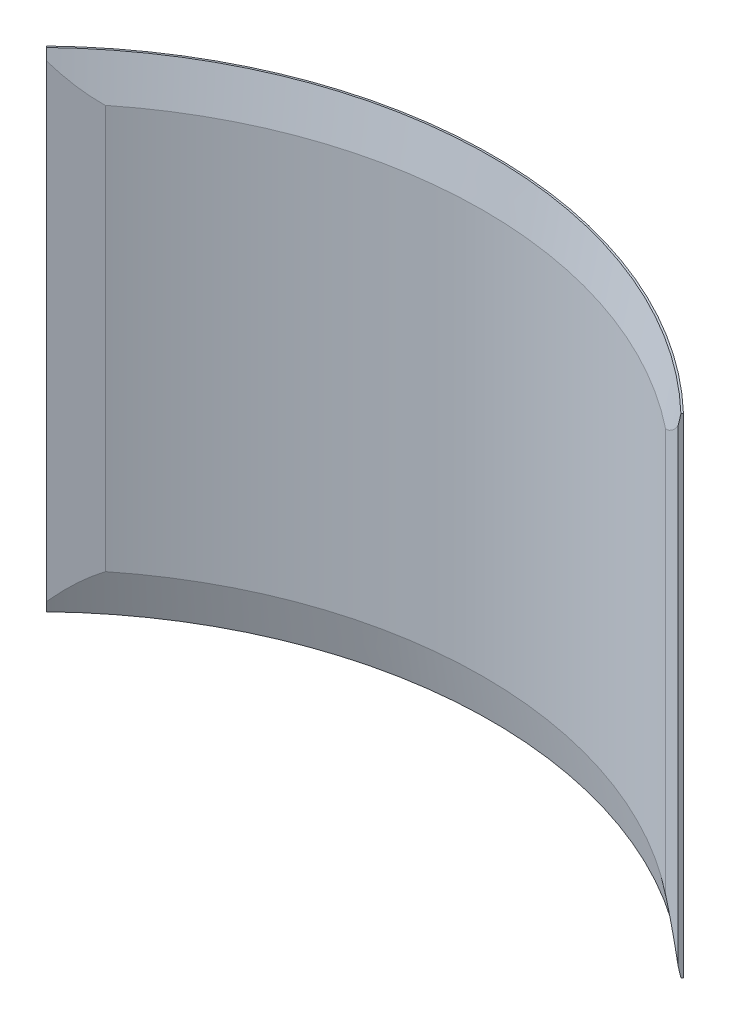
ISO-10303-21;
HEADER;
FILE_DESCRIPTION(('STEP AP214'),'2;1');
FILE_NAME('part.step','',(''),(''),'','','');
FILE_SCHEMA(('AUTOMOTIVE_DESIGN { 1 0 10303 214 1 1 1 1 }'));
ENDSEC;
DATA;
#1=APPLICATION_CONTEXT('core data for automotive mechanical design processes');
#2=APPLICATION_PROTOCOL_DEFINITION('international standard','automotive_design',2000,#1);
#3=PRODUCT_CONTEXT('',#1,'mechanical');
#4=PRODUCT('Part','Part','',(#3));
#5=PRODUCT_RELATED_PRODUCT_CATEGORY('part','',(#4));
#6=PRODUCT_DEFINITION_FORMATION('','',#4);
#7=PRODUCT_DEFINITION_CONTEXT('part definition',#1,'design');
#8=PRODUCT_DEFINITION('design','',#6,#7);
#9=PRODUCT_DEFINITION_SHAPE('','',#8);
#10=(LENGTH_UNIT() NAMED_UNIT(*) SI_UNIT(.MILLI.,.METRE.));
#11=(NAMED_UNIT(*) PLANE_ANGLE_UNIT() SI_UNIT($,.RADIAN.));
#12=(NAMED_UNIT(*) SI_UNIT($,.STERADIAN.) SOLID_ANGLE_UNIT());
#13=UNCERTAINTY_MEASURE_WITH_UNIT(LENGTH_MEASURE(1.E-05),#10,'distance_accuracy_value','');
#14=(GEOMETRIC_REPRESENTATION_CONTEXT(3) GLOBAL_UNCERTAINTY_ASSIGNED_CONTEXT((#13)) GLOBAL_UNIT_ASSIGNED_CONTEXT((#10,
#11,#12)) REPRESENTATION_CONTEXT('',''));
#15=CARTESIAN_POINT('',(0.,0.,0.));
#16=DIRECTION('',(0.,0.,1.));
#17=DIRECTION('',(1.,0.,0.));
#18=AXIS2_PLACEMENT_3D('',#15,#16,#17);
#19=CARTESIAN_POINT('',(81.915,125.73,85.0961057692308));
#20=DIRECTION('',(0.,-1.,0.));
#21=DIRECTION('',(0.,0.,-1.));
#22=AXIS2_PLACEMENT_3D('',#19,#20,#21);
#23=CYLINDRICAL_SURFACE('',#22,115.576105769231);
#24=DIRECTION('',(0.,-1.,0.));
#25=VECTOR('',#24,1.);
#26=CARTESIAN_POINT('',(9.83701288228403,125.73,-5.25100263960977));
#27=LINE('',#26,#25);
#28=CARTESIAN_POINT('',(9.83701288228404,114.808,-5.25100263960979));
#29=VERTEX_POINT('',#28);
#30=CARTESIAN_POINT('',(9.83701288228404,10.922,-5.25100263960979));
#31=VERTEX_POINT('',#30);
#32=EDGE_CURVE('E105',#29,#31,#27,.T.);
#33=ORIENTED_EDGE('',*,*,#32,.T.);
#34=CARTESIAN_POINT('',(81.915,10.922,85.0961057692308));
#35=DIRECTION('',(0.,1.,0.));
#36=DIRECTION('',(0.,0.,1.));
#37=AXIS2_PLACEMENT_3D('',#34,#35,#36);
#38=CIRCLE('',#37,115.576105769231);
#39=CARTESIAN_POINT('',(153.992987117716,10.922,-5.25100263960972));
#40=VERTEX_POINT('',#39);
#41=EDGE_CURVE('E136',#31,#40,#38,.F.);
#42=ORIENTED_EDGE('',*,*,#41,.T.);
#43=DIRECTION('',(0.,-1.,0.));
#44=VECTOR('',#43,1.);
#45=CARTESIAN_POINT('',(153.992987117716,125.73,-5.2510026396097));
#46=LINE('',#45,#44);
#47=CARTESIAN_POINT('',(153.992987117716,114.808,-5.25100263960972));
#48=VERTEX_POINT('',#47);
#49=EDGE_CURVE('E134',#40,#48,#46,.F.);
#50=ORIENTED_EDGE('',*,*,#49,.T.);
#51=CARTESIAN_POINT('',(81.915,114.808,85.0961057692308));
#52=DIRECTION('',(0.,1.,0.));
#53=DIRECTION('',(0.,0.,1.));
#54=AXIS2_PLACEMENT_3D('',#51,#52,#53);
#55=CIRCLE('',#54,115.576105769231);
#56=EDGE_CURVE('E132',#48,#29,#55,.T.);
#57=ORIENTED_EDGE('',*,*,#56,.T.);
#58=EDGE_LOOP('',(#33,#42,#50,#57));
#59=FACE_BOUND('',#58,.T.);
#60=ADVANCED_FACE('F34',(#59),#23,.F.);
#61=CARTESIAN_POINT('',(163.83,125.73,0.));
#62=DIRECTION('',(0.720444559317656,0.,0.693512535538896));
#63=DIRECTION('',(0.693512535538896,0.,-0.720444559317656));
#64=AXIS2_PLACEMENT_3D('',#61,#62,#63);
#65=PLANE('',#64);
#66=DIRECTION('',(0.,-1.,0.));
#67=VECTOR('',#66,1.);
#68=CARTESIAN_POINT('',(163.160601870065,0.,0.695393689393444));
#69=LINE('',#68,#67);
#70=CARTESIAN_POINT('',(163.160601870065,123.065947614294,0.695393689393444));
#71=VERTEX_POINT('',#70);
#72=CARTESIAN_POINT('',(163.160601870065,2.66405238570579,0.695393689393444));
#73=VERTEX_POINT('',#72);
#74=EDGE_CURVE('E141',#71,#73,#69,.T.);
#75=ORIENTED_EDGE('',*,*,#74,.T.);
#76=DIRECTION('',(-0.129910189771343,0.982298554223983,0.134955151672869));
#77=VECTOR('',#76,1.);
#78=CARTESIAN_POINT('',(81.9150000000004,616.991822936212,85.0961057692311));
#79=LINE('',#78,#77);
#80=CARTESIAN_POINT('',(163.512926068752,0.,0.329387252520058));
#81=VERTEX_POINT('',#80);
#82=EDGE_CURVE('E112',#73,#81,#79,.F.);
#83=ORIENTED_EDGE('',*,*,#82,.T.);
#84=DIRECTION('',(-0.693512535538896,0.,0.720444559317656));
#85=VECTOR('',#84,1.);
#86=CARTESIAN_POINT('',(163.83,0.,0.));
#87=LINE('',#86,#85);
#88=CARTESIAN_POINT('',(163.83,0.,0.));
#89=VERTEX_POINT('',#88);
#90=EDGE_CURVE('E109',#89,#81,#87,.T.);
#91=ORIENTED_EDGE('',*,*,#90,.F.);
#92=DIRECTION('',(0.,-1.,0.));
#93=VECTOR('',#92,1.);
#94=CARTESIAN_POINT('',(163.83,125.73,0.));
#95=LINE('',#94,#93);
#96=CARTESIAN_POINT('',(163.83,125.73,0.));
#97=VERTEX_POINT('',#96);
#98=EDGE_CURVE('E94',#97,#89,#95,.T.);
#99=ORIENTED_EDGE('',*,*,#98,.F.);
#100=DIRECTION('',(-0.693512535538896,0.,0.720444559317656));
#101=VECTOR('',#100,1.);
#102=CARTESIAN_POINT('',(163.83,125.73,0.));
#103=LINE('',#102,#101);
#104=CARTESIAN_POINT('',(163.512926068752,125.73,0.329387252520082));
#105=VERTEX_POINT('',#104);
#106=EDGE_CURVE('E122',#97,#105,#103,.T.);
#107=ORIENTED_EDGE('',*,*,#106,.T.);
#108=DIRECTION('',(0.129910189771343,0.982298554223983,-0.134955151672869));
#109=VECTOR('',#108,1.);
#110=CARTESIAN_POINT('',(81.9150000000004,-491.261822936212,85.0961057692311));
#111=LINE('',#110,#109);
#112=EDGE_CURVE('E139',#105,#71,#111,.F.);
#113=ORIENTED_EDGE('',*,*,#112,.T.);
#114=EDGE_LOOP('',(#75,#83,#91,#99,#107,#113));
#115=FACE_BOUND('',#114,.T.);
#116=ADVANCED_FACE('F110',(#115),#65,.T.);
#117=CARTESIAN_POINT('',(81.915,125.73,85.0961057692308));
#118=DIRECTION('',(0.,-1.,0.));
#119=DIRECTION('',(0.,0.,-1.));
#120=AXIS2_PLACEMENT_3D('',#117,#118,#119);
#121=CYLINDRICAL_SURFACE('',#120,118.116105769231);
#122=CARTESIAN_POINT('',(81.915,0.,85.0961057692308));
#123=DIRECTION('',(0.,-1.,0.));
#124=DIRECTION('',(0.,0.,-1.));
#125=AXIS2_PLACEMENT_3D('',#122,#123,#124);
#126=CIRCLE('',#125,118.116105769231);
#127=CARTESIAN_POINT('',(0.,0.,0.));
#128=VERTEX_POINT('',#127);
#129=EDGE_CURVE('E99',#128,#89,#126,.T.);
#130=ORIENTED_EDGE('',*,*,#129,.F.);
#131=DIRECTION('',(0.,-1.,0.));
#132=VECTOR('',#131,1.);
#133=CARTESIAN_POINT('',(0.,125.73,0.));
#134=LINE('',#133,#132);
#135=CARTESIAN_POINT('',(0.,125.73,0.));
#136=VERTEX_POINT('',#135);
#137=EDGE_CURVE('E106',#136,#128,#134,.T.);
#138=ORIENTED_EDGE('',*,*,#137,.F.);
#139=CARTESIAN_POINT('',(81.915,125.73,85.0961057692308));
#140=DIRECTION('',(0.,-1.,0.));
#141=DIRECTION('',(0.,0.,-1.));
#142=AXIS2_PLACEMENT_3D('',#139,#140,#141);
#143=CIRCLE('',#142,118.116105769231);
#144=EDGE_CURVE('E101',#136,#97,#143,.T.);
#145=ORIENTED_EDGE('',*,*,#144,.T.);
#146=ORIENTED_EDGE('',*,*,#98,.T.);
#147=EDGE_LOOP('',(#130,#138,#145,#146));
#148=FACE_BOUND('',#147,.T.);
#149=ADVANCED_FACE('F96',(#148),#121,.T.);
#150=CARTESIAN_POINT('',(1.76152184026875,125.73,1.82992918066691));
#151=DIRECTION('',(-0.720444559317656,0.,0.693512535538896));
#152=DIRECTION('',(0.693512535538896,0.,0.720444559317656));
#153=AXIS2_PLACEMENT_3D('',#150,#151,#152);
#154=PLANE('',#153);
#155=DIRECTION('',(-0.693512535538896,0.,-0.720444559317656));
#156=VECTOR('',#155,1.);
#157=CARTESIAN_POINT('',(1.76152184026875,0.,1.82992918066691));
#158=LINE('',#157,#156);
#159=CARTESIAN_POINT('',(0.317073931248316,-1.66533453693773E-13,0.329387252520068));
#160=VERTEX_POINT('',#159);
#161=EDGE_CURVE('E119',#160,#128,#158,.T.);
#162=ORIENTED_EDGE('',*,*,#161,.F.);
#163=DIRECTION('',(-0.129910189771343,-0.982298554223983,-0.134955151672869));
#164=VECTOR('',#163,1.);
#165=CARTESIAN_POINT('',(81.9149999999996,616.991822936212,85.0961057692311));
#166=LINE('',#165,#164);
#167=CARTESIAN_POINT('',(0.669398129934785,2.66405238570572,0.695393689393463));
#168=VERTEX_POINT('',#167);
#169=EDGE_CURVE('E41',#160,#168,#166,.F.);
#170=ORIENTED_EDGE('',*,*,#169,.T.);
#171=DIRECTION('',(0.,1.,0.));
#172=VECTOR('',#171,1.);
#173=CARTESIAN_POINT('',(0.669398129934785,125.73,0.695393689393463));
#174=LINE('',#173,#172);
#175=CARTESIAN_POINT('',(0.669398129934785,123.065947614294,0.695393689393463));
#176=VERTEX_POINT('',#175);
#177=EDGE_CURVE('E48',#168,#176,#174,.T.);
#178=ORIENTED_EDGE('',*,*,#177,.T.);
#179=DIRECTION('',(0.129910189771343,-0.982298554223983,0.134955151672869));
#180=VECTOR('',#179,1.);
#181=CARTESIAN_POINT('',(81.9149999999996,-491.261822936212,85.0961057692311));
#182=LINE('',#181,#180);
#183=CARTESIAN_POINT('',(0.317073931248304,125.73,0.329387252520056));
#184=VERTEX_POINT('',#183);
#185=EDGE_CURVE('E147',#176,#184,#182,.F.);
#186=ORIENTED_EDGE('',*,*,#185,.T.);
#187=DIRECTION('',(-0.693512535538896,0.,-0.720444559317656));
#188=VECTOR('',#187,1.);
#189=CARTESIAN_POINT('',(1.76152184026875,125.73,1.82992918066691));
#190=LINE('',#189,#188);
#191=EDGE_CURVE('E128',#184,#136,#190,.T.);
#192=ORIENTED_EDGE('',*,*,#191,.T.);
#193=ORIENTED_EDGE('',*,*,#137,.T.);
#194=EDGE_LOOP('',(#162,#170,#178,#186,#192,#193));
#195=FACE_BOUND('',#194,.T.);
#196=ADVANCED_FACE('F149',(#195),#154,.T.);
#197=CARTESIAN_POINT('',(81.915,125.73,85.0961057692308));
#198=DIRECTION('',(0.,1.,0.));
#199=DIRECTION('',(0.,0.,1.));
#200=AXIS2_PLACEMENT_3D('',#197,#198,#199);
#201=PLANE('',#200);
#202=ORIENTED_EDGE('',*,*,#191,.F.);
#203=CARTESIAN_POINT('',(81.915,125.73,85.0961057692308));
#204=DIRECTION('',(0.,1.,0.));
#205=DIRECTION('',(0.,0.,1.));
#206=AXIS2_PLACEMENT_3D('',#203,#204,#205);
#207=CIRCLE('',#206,117.658905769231);
#208=EDGE_CURVE('E11',#184,#105,#207,.F.);
#209=ORIENTED_EDGE('',*,*,#208,.T.);
#210=ORIENTED_EDGE('',*,*,#106,.F.);
#211=ORIENTED_EDGE('',*,*,#144,.F.);
#212=EDGE_LOOP('',(#202,#209,#210,#211));
#213=FACE_BOUND('',#212,.T.);
#214=ADVANCED_FACE('F155',(#213),#201,.T.);
#215=CARTESIAN_POINT('',(81.915,0.,85.0961057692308));
#216=DIRECTION('',(0.,1.,0.));
#217=DIRECTION('',(0.,0.,1.));
#218=AXIS2_PLACEMENT_3D('',#215,#216,#217);
#219=PLANE('',#218);
#220=ORIENTED_EDGE('',*,*,#90,.T.);
#221=CARTESIAN_POINT('',(81.915,0.,85.0961057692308));
#222=DIRECTION('',(0.,1.,0.));
#223=DIRECTION('',(0.,0.,1.));
#224=AXIS2_PLACEMENT_3D('',#221,#222,#223);
#225=CIRCLE('',#224,117.658905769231);
#226=EDGE_CURVE('E144',#81,#160,#225,.T.);
#227=ORIENTED_EDGE('',*,*,#226,.T.);
#228=ORIENTED_EDGE('',*,*,#161,.T.);
#229=ORIENTED_EDGE('',*,*,#129,.T.);
#230=EDGE_LOOP('',(#220,#227,#228,#229));
#231=FACE_BOUND('',#230,.T.);
#232=ADVANCED_FACE('F118',(#231),#219,.F.);
#233=CARTESIAN_POINT('',(81.915,125.73,85.0961057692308));
#234=DIRECTION('',(0.,1.,0.));
#235=DIRECTION('',(0.,0.,1.));
#236=AXIS2_PLACEMENT_3D('',#233,#234,#235);
#237=CONICAL_SURFACE('',#236,117.658905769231,0.188435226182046);
#238=ORIENTED_EDGE('',*,*,#208,.F.);
#239=ORIENTED_EDGE('',*,*,#185,.F.);
#240=CARTESIAN_POINT('',(9.83701288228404,114.808,-5.25100263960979));
#241=CARTESIAN_POINT('',(9.4076831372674,115.070526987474,-4.97252618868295));
#242=CARTESIAN_POINT('',(8.98449875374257,115.346905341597,-4.69803580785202));
#243=CARTESIAN_POINT('',(8.15042151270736,115.924357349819,-4.15702770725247));
#244=CARTESIAN_POINT('',(7.73952262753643,116.225418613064,-3.89050607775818));
#245=CARTESIAN_POINT('',(6.52939146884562,117.157861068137,-3.1055778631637));
#246=CARTESIAN_POINT('',(5.74767704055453,117.821660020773,-2.59853389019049));
#247=CARTESIAN_POINT('',(4.22895517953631,119.216404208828,-1.61344427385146));
#248=CARTESIAN_POINT('',(3.49192078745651,119.947308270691,-1.13538114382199));
#249=CARTESIAN_POINT('',(2.41421104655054,121.085810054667,-0.43634552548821));
#250=CARTESIAN_POINT('',(2.05858963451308,121.47356283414,-0.205678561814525));
#251=CARTESIAN_POINT('',(1.35695484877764,122.261074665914,0.249423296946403));
#252=CARTESIAN_POINT('',(1.01093958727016,122.660831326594,0.473859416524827));
#253=CARTESIAN_POINT('',(0.669398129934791,123.065947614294,0.69539368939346));
#254=B_SPLINE_CURVE_WITH_KNOTS('',3,(#240,#241,#242,#243,#244,#245,#246,#247,#248,#249,#250,
#251,#252,#253),.UNSPECIFIED.,.F.,.F.,(4,2,2,2,2,2,4),(0.,1.72491646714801,3.44897226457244,
6.87678074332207,10.3024999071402,12.0257359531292,13.7486309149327),.UNSPECIFIED.);
#255=EDGE_CURVE('E116',#29,#176,#254,.T.);
#256=ORIENTED_EDGE('',*,*,#255,.F.);
#257=ORIENTED_EDGE('',*,*,#56,.F.);
#258=CARTESIAN_POINT('',(153.992987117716,114.808,-5.25100263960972));
#259=CARTESIAN_POINT('',(154.422316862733,115.070526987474,-4.97252618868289));
#260=CARTESIAN_POINT('',(154.845501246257,115.346905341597,-4.69803580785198));
#261=CARTESIAN_POINT('',(155.679578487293,115.924357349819,-4.15702770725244));
#262=CARTESIAN_POINT('',(156.090477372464,116.225418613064,-3.89050607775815));
#263=CARTESIAN_POINT('',(157.300608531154,117.157861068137,-3.10557786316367));
#264=CARTESIAN_POINT('',(158.082322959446,117.821660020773,-2.59853389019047));
#265=CARTESIAN_POINT('',(159.601044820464,119.216404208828,-1.61344427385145));
#266=CARTESIAN_POINT('',(160.338079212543,119.947308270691,-1.13538114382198));
#267=CARTESIAN_POINT('',(161.415788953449,121.085810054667,-0.436345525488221));
#268=CARTESIAN_POINT('',(161.771410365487,121.47356283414,-0.205678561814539));
#269=CARTESIAN_POINT('',(162.473045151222,122.261074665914,0.24942329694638));
#270=CARTESIAN_POINT('',(162.81906041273,122.660831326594,0.473859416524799));
#271=CARTESIAN_POINT('',(163.160601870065,123.065947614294,0.695393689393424));
#272=B_SPLINE_CURVE_WITH_KNOTS('',3,(#258,#259,#260,#261,#262,#263,#264,#265,#266,#267,#268,
#269,#270,#271),.UNSPECIFIED.,.F.,.F.,(4,2,2,2,2,2,4),(0.,1.72491646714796,3.44897226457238,
6.876780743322,10.3024999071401,12.0257359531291,13.7486309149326),.UNSPECIFIED.);
#273=EDGE_CURVE('E161',#71,#48,#272,.F.);
#274=ORIENTED_EDGE('',*,*,#273,.F.);
#275=ORIENTED_EDGE('',*,*,#112,.F.);
#276=EDGE_LOOP('',(#238,#239,#256,#257,#274,#275));
#277=FACE_BOUND('',#276,.T.);
#278=ADVANCED_FACE('F157',(#277),#237,.F.);
#279=CARTESIAN_POINT('',(9.83701288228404,125.73,-5.2510026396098));
#280=DIRECTION('',(-0.544180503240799,0.,-0.838968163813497));
#281=DIRECTION('',(-0.838968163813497,0.,0.544180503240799));
#282=AXIS2_PLACEMENT_3D('',#279,#280,#281);
#283=PLANE('',#282);
#284=ORIENTED_EDGE('',*,*,#255,.T.);
#285=ORIENTED_EDGE('',*,*,#177,.F.);
#286=CARTESIAN_POINT('',(0.669398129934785,2.66405238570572,0.695393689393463));
#287=CARTESIAN_POINT('',(1.01093958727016,3.06916867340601,0.473859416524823));
#288=CARTESIAN_POINT('',(1.35695484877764,3.46892533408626,0.249423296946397));
#289=CARTESIAN_POINT('',(2.05858963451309,4.25643716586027,-0.205678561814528));
#290=CARTESIAN_POINT('',(2.41421104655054,4.64418994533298,-0.43634552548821));
#291=CARTESIAN_POINT('',(3.4919207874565,5.78269172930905,-1.13538114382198));
#292=CARTESIAN_POINT('',(4.22895517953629,6.51359579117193,-1.61344427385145));
#293=CARTESIAN_POINT('',(5.7476770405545,7.90833997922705,-2.59853389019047));
#294=CARTESIAN_POINT('',(6.52939146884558,8.57213893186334,-3.10557786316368));
#295=CARTESIAN_POINT('',(7.73952262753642,9.50458138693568,-3.89050607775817));
#296=CARTESIAN_POINT('',(8.15042151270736,9.80564265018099,-4.15702770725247));
#297=CARTESIAN_POINT('',(8.98449875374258,10.3830946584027,-4.69803580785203));
#298=CARTESIAN_POINT('',(9.40768313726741,10.6594730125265,-4.97252618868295));
#299=CARTESIAN_POINT('',(9.83701288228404,10.922,-5.2510026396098));
#300=B_SPLINE_CURVE_WITH_KNOTS('',3,(#286,#287,#288,#289,#290,#291,#292,#293,#294,#295,#296,
#297,#298,#299),.UNSPECIFIED.,.F.,.F.,(4,2,2,2,2,2,4),(0.,1.72289496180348,3.44613100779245,
6.87185017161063,10.2996586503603,12.0237144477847,13.7486309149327),.UNSPECIFIED.);
#301=EDGE_CURVE('E170',#31,#168,#300,.F.);
#302=ORIENTED_EDGE('',*,*,#301,.F.);
#303=ORIENTED_EDGE('',*,*,#32,.F.);
#304=EDGE_LOOP('',(#284,#285,#302,#303));
#305=FACE_BOUND('',#304,.T.);
#306=ADVANCED_FACE('F192',(#305),#283,.F.);
#307=CARTESIAN_POINT('',(163.160601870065,125.73,0.695393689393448));
#308=DIRECTION('',(0.544180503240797,0.,-0.838968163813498));
#309=DIRECTION('',(-0.838968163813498,0.,-0.544180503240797));
#310=AXIS2_PLACEMENT_3D('',#307,#308,#309);
#311=PLANE('',#310);
#312=ORIENTED_EDGE('',*,*,#273,.T.);
#313=ORIENTED_EDGE('',*,*,#49,.F.);
#314=CARTESIAN_POINT('',(153.992987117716,10.922,-5.25100263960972));
#315=CARTESIAN_POINT('',(154.422316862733,10.6594730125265,-4.97252618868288));
#316=CARTESIAN_POINT('',(154.845501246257,10.3830946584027,-4.69803580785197));
#317=CARTESIAN_POINT('',(155.679578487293,9.80564265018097,-4.15702770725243));
#318=CARTESIAN_POINT('',(156.090477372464,9.50458138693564,-3.89050607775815));
#319=CARTESIAN_POINT('',(157.300608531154,8.57213893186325,-3.10557786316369));
#320=CARTESIAN_POINT('',(158.082322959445,7.908339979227,-2.59853389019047));
#321=CARTESIAN_POINT('',(159.601044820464,6.51359579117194,-1.61344427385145));
#322=CARTESIAN_POINT('',(160.338079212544,5.78269172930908,-1.13538114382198));
#323=CARTESIAN_POINT('',(161.415788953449,4.644189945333,-0.436345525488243));
#324=CARTESIAN_POINT('',(161.771410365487,4.25643716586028,-0.205678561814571));
#325=CARTESIAN_POINT('',(162.473045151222,3.46892533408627,0.249423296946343));
#326=CARTESIAN_POINT('',(162.81906041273,3.06916867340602,0.473859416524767));
#327=CARTESIAN_POINT('',(163.160601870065,2.66405238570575,0.695393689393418));
#328=B_SPLINE_CURVE_WITH_KNOTS('',3,(#314,#315,#316,#317,#318,#319,#320,#321,#322,#323,#324,
#325,#326,#327),.UNSPECIFIED.,.F.,.F.,(4,2,2,2,2,2,4),(0.,1.72491646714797,3.44897226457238,
6.876780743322,10.3024999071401,12.025735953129,13.7486309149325),.UNSPECIFIED.);
#329=EDGE_CURVE('E166',#73,#40,#328,.F.);
#330=ORIENTED_EDGE('',*,*,#329,.F.);
#331=ORIENTED_EDGE('',*,*,#74,.F.);
#332=EDGE_LOOP('',(#312,#313,#330,#331));
#333=FACE_BOUND('',#332,.T.);
#334=ADVANCED_FACE('F167',(#333),#311,.F.);
#335=CARTESIAN_POINT('',(81.915,10.922,85.0961057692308));
#336=DIRECTION('',(0.,-1.,0.));
#337=DIRECTION('',(0.,0.,-1.));
#338=AXIS2_PLACEMENT_3D('',#335,#336,#337);
#339=CONICAL_SURFACE('',#338,115.576105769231,0.188435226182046);
#340=ORIENTED_EDGE('',*,*,#169,.F.);
#341=ORIENTED_EDGE('',*,*,#226,.F.);
#342=ORIENTED_EDGE('',*,*,#82,.F.);
#343=ORIENTED_EDGE('',*,*,#329,.T.);
#344=ORIENTED_EDGE('',*,*,#41,.F.);
#345=ORIENTED_EDGE('',*,*,#301,.T.);
#346=EDGE_LOOP('',(#340,#341,#342,#343,#344,#345));
#347=FACE_BOUND('',#346,.T.);
#348=ADVANCED_FACE('F172',(#347),#339,.F.);
#349=CLOSED_SHELL('',(#60,#116,#149,#196,#214,#232,#278,#306,#334,#348));
#350=MANIFOLD_SOLID_BREP('B2',#349);
#351=ADVANCED_BREP_SHAPE_REPRESENTATION('',(#18,#350),#14);
#352=SHAPE_DEFINITION_REPRESENTATION(#9,#351);
ENDSEC;
END-ISO-10303-21;
